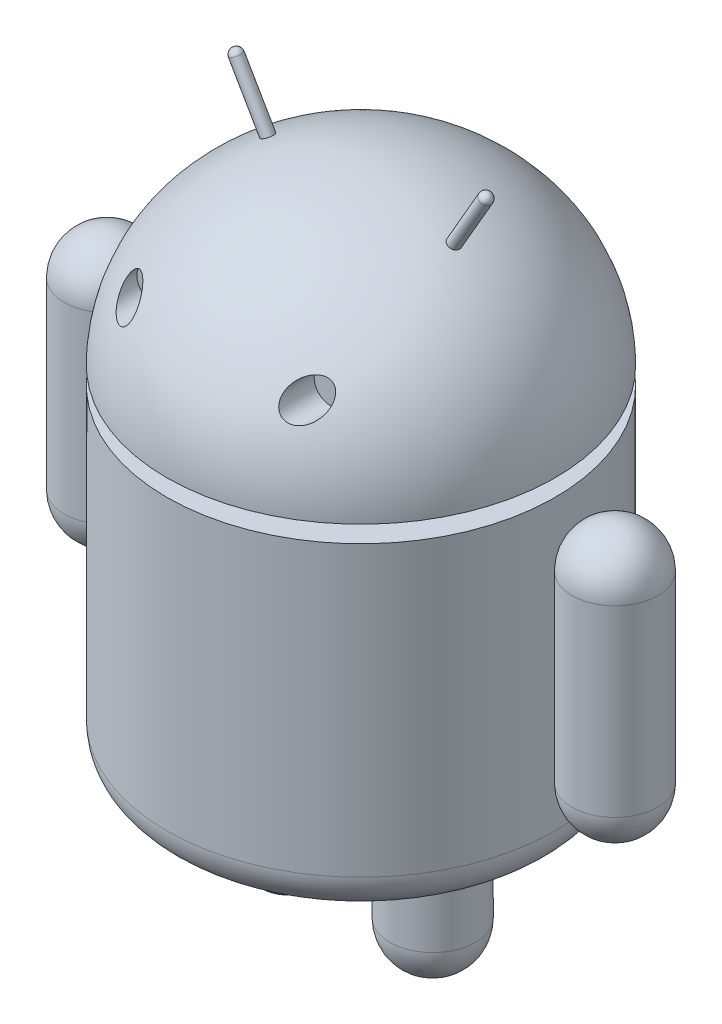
ISO-10303-21;
HEADER;
FILE_DESCRIPTION(('STEP AP214'),'2;1');
FILE_NAME('part.step','',(''),(''),'','','');
FILE_SCHEMA(('AUTOMOTIVE_DESIGN { 1 0 10303 214 1 1 1 1 }'));
ENDSEC;
DATA;
#1=APPLICATION_CONTEXT('core data for automotive mechanical design processes');
#2=APPLICATION_PROTOCOL_DEFINITION('international standard','automotive_design',2000,#1);
#3=PRODUCT_CONTEXT('',#1,'mechanical');
#4=PRODUCT('Part','Part','',(#3));
#5=PRODUCT_RELATED_PRODUCT_CATEGORY('part','',(#4));
#6=PRODUCT_DEFINITION_FORMATION('','',#4);
#7=PRODUCT_DEFINITION_CONTEXT('part definition',#1,'design');
#8=PRODUCT_DEFINITION('design','',#6,#7);
#9=PRODUCT_DEFINITION_SHAPE('','',#8);
#10=(LENGTH_UNIT() NAMED_UNIT(*) SI_UNIT(.MILLI.,.METRE.));
#11=(NAMED_UNIT(*) PLANE_ANGLE_UNIT() SI_UNIT($,.RADIAN.));
#12=(NAMED_UNIT(*) SI_UNIT($,.STERADIAN.) SOLID_ANGLE_UNIT());
#13=UNCERTAINTY_MEASURE_WITH_UNIT(LENGTH_MEASURE(1.E-05),#10,'distance_accuracy_value','');
#14=(GEOMETRIC_REPRESENTATION_CONTEXT(3) GLOBAL_UNCERTAINTY_ASSIGNED_CONTEXT((#13)) GLOBAL_UNIT_ASSIGNED_CONTEXT((#10,
#11,#12)) REPRESENTATION_CONTEXT('',''));
#15=CARTESIAN_POINT('',(0.,0.,0.));
#16=DIRECTION('',(0.,0.,1.));
#17=DIRECTION('',(1.,0.,0.));
#18=AXIS2_PLACEMENT_3D('',#15,#16,#17);
#19=CARTESIAN_POINT('',(64.77,75.184,0.));
#20=DIRECTION('',(0.,1.,0.));
#21=DIRECTION('',(-1.,0.,0.));
#22=AXIS2_PLACEMENT_3D('',#19,#20,#21);
#23=SPHERICAL_SURFACE('',#22,10.922);
#24=CARTESIAN_POINT('',(64.77,75.184,0.));
#25=DIRECTION('',(0.,-1.,0.));
#26=DIRECTION('',(1.,0.,0.));
#27=AXIS2_PLACEMENT_3D('',#24,#25,#26);
#28=CIRCLE('',#27,10.922);
#29=CARTESIAN_POINT('',(75.692,75.184,0.));
#30=VERTEX_POINT('',#29);
#31=EDGE_CURVE('E44',#30,#30,#28,.T.);
#32=ORIENTED_EDGE('',*,*,#31,.F.);
#33=EDGE_LOOP('',(#32));
#34=FACE_BOUND('',#33,.T.);
#35=ADVANCED_FACE('F38',(#34),#23,.T.);
#36=CARTESIAN_POINT('',(64.77,28.448,0.));
#37=DIRECTION('',(0.,1.,0.));
#38=DIRECTION('',(-1.,0.,0.));
#39=AXIS2_PLACEMENT_3D('',#36,#37,#38);
#40=SPHERICAL_SURFACE('',#39,10.922);
#41=CARTESIAN_POINT('',(64.77,28.448,0.));
#42=DIRECTION('',(0.,-1.,0.));
#43=DIRECTION('',(1.,0.,0.));
#44=AXIS2_PLACEMENT_3D('',#41,#42,#43);
#45=CIRCLE('',#44,10.922);
#46=CARTESIAN_POINT('',(75.692,28.448,0.));
#47=VERTEX_POINT('',#46);
#48=EDGE_CURVE('E11',#47,#47,#45,.T.);
#49=ORIENTED_EDGE('',*,*,#48,.T.);
#50=EDGE_LOOP('',(#49));
#51=FACE_BOUND('',#50,.T.);
#52=ADVANCED_FACE('F54',(#51),#40,.T.);
#53=CARTESIAN_POINT('',(64.77,86.106,0.));
#54=DIRECTION('',(0.,1.,0.));
#55=DIRECTION('',(1.,0.,0.));
#56=AXIS2_PLACEMENT_3D('',#53,#54,#55);
#57=CYLINDRICAL_SURFACE('',#56,10.922);
#58=ORIENTED_EDGE('',*,*,#31,.T.);
#59=EDGE_LOOP('',(#58));
#60=FACE_BOUND('',#59,.T.);
#61=ORIENTED_EDGE('',*,*,#48,.F.);
#62=EDGE_LOOP('',(#61));
#63=FACE_BOUND('',#62,.T.);
#64=ADVANCED_FACE('F50',(#60,#63),#57,.T.);
#65=CLOSED_SHELL('',(#35,#52,#64));
#66=MANIFOLD_SOLID_BREP('B2',#65);
#67=CARTESIAN_POINT('',(-64.77,75.184,0.));
#68=DIRECTION('',(0.,1.,0.));
#69=DIRECTION('',(1.,0.,0.));
#70=AXIS2_PLACEMENT_3D('',#67,#68,#69);
#71=SPHERICAL_SURFACE('',#70,10.922);
#72=CARTESIAN_POINT('',(-64.77,75.184,0.));
#73=DIRECTION('',(0.,1.,0.));
#74=DIRECTION('',(-1.,0.,0.));
#75=AXIS2_PLACEMENT_3D('',#72,#73,#74);
#76=CIRCLE('',#75,10.922);
#77=CARTESIAN_POINT('',(-75.692,75.184,0.));
#78=VERTEX_POINT('',#77);
#79=EDGE_CURVE('E95',#78,#78,#76,.T.);
#80=ORIENTED_EDGE('',*,*,#79,.T.);
#81=EDGE_LOOP('',(#80));
#82=FACE_BOUND('',#81,.T.);
#83=ADVANCED_FACE('F89',(#82),#71,.T.);
#84=CARTESIAN_POINT('',(-64.77,28.448,0.));
#85=DIRECTION('',(0.,1.,0.));
#86=DIRECTION('',(1.,0.,0.));
#87=AXIS2_PLACEMENT_3D('',#84,#85,#86);
#88=SPHERICAL_SURFACE('',#87,10.922);
#89=CARTESIAN_POINT('',(-64.77,28.448,0.));
#90=DIRECTION('',(0.,1.,0.));
#91=DIRECTION('',(-1.,0.,0.));
#92=AXIS2_PLACEMENT_3D('',#89,#90,#91);
#93=CIRCLE('',#92,10.922);
#94=CARTESIAN_POINT('',(-75.692,28.448,0.));
#95=VERTEX_POINT('',#94);
#96=EDGE_CURVE('E37',#95,#95,#93,.T.);
#97=ORIENTED_EDGE('',*,*,#96,.F.);
#98=EDGE_LOOP('',(#97));
#99=FACE_BOUND('',#98,.T.);
#100=ADVANCED_FACE('F104',(#99),#88,.T.);
#101=CARTESIAN_POINT('',(-64.77,86.106,0.));
#102=DIRECTION('',(0.,1.,0.));
#103=DIRECTION('',(-1.,0.,0.));
#104=AXIS2_PLACEMENT_3D('',#101,#102,#103);
#105=CYLINDRICAL_SURFACE('',#104,10.922);
#106=ORIENTED_EDGE('',*,*,#79,.F.);
#107=EDGE_LOOP('',(#106));
#108=FACE_BOUND('',#107,.T.);
#109=ORIENTED_EDGE('',*,*,#96,.T.);
#110=EDGE_LOOP('',(#109));
#111=FACE_BOUND('',#110,.T.);
#112=ADVANCED_FACE('F102',(#108,#111),#105,.T.);
#113=CLOSED_SHELL('',(#83,#100,#112));
#114=MANIFOLD_SOLID_BREP('B6',#113);
#115=CARTESIAN_POINT('',(0.,88.138,0.));
#116=DIRECTION('',(1.,0.,0.));
#117=DIRECTION('',(0.,0.,1.));
#118=AXIS2_PLACEMENT_3D('',#115,#116,#117);
#119=ELLIPSE('',#118,49.53,44.45);
#120=TRIMMED_CURVE('',#119,(PARAMETER_VALUE(4.71238898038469)),
(PARAMETER_VALUE(7.85398163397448)),.T.,.PARAMETER.);
#121=CARTESIAN_POINT('',(0.,83.82,0.));
#122=DIRECTION('',(0.,1.,0.));
#123=AXIS1_PLACEMENT('',#121,#122);
#124=SURFACE_OF_REVOLUTION('',#120,#123);
#125=CARTESIAN_POINT('',(-22.3992248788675,127.782891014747,0.));
#126=CARTESIAN_POINT('',(-22.399230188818,127.782888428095,0.0854670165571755));
#127=CARTESIAN_POINT('',(-22.4057285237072,127.779708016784,0.171023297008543));
#128=CARTESIAN_POINT('',(-22.4250581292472,127.770246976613,0.297450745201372));
#129=CARTESIAN_POINT('',(-22.4331089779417,127.766306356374,0.339309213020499));
#130=CARTESIAN_POINT('',(-22.4523542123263,127.756886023,0.422163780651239));
#131=CARTESIAN_POINT('',(-22.4635513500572,127.751404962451,0.463159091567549));
#132=CARTESIAN_POINT('',(-22.501715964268,127.732722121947,0.584236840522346));
#133=CARTESIAN_POINT('',(-22.5332828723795,127.7172678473,0.662581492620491));
#134=CARTESIAN_POINT('',(-22.6077820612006,127.680788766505,0.812258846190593));
#135=CARTESIAN_POINT('',(-22.6507147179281,127.659763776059,0.883591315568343));
#136=CARTESIAN_POINT('',(-22.7226855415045,127.624510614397,0.983830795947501));
#137=CARTESIAN_POINT('',(-22.7479724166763,127.612123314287,1.01615184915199));
#138=CARTESIAN_POINT('',(-22.8008680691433,127.586208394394,1.07828352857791));
#139=CARTESIAN_POINT('',(-22.828474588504,127.572681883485,1.10809654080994));
#140=CARTESIAN_POINT('',(-22.9145490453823,127.530502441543,1.19351377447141));
#141=CARTESIAN_POINT('',(-22.9762891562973,127.500241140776,1.24512019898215));
#142=CARTESIAN_POINT('',(-23.1067569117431,127.436275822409,1.33617214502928));
#143=CARTESIAN_POINT('',(-23.1754995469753,127.402564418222,1.37559081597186));
#144=CARTESIAN_POINT('',(-23.3179424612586,127.332689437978,1.4410518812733));
#145=CARTESIAN_POINT('',(-23.3916427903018,127.296525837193,1.46709414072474));
#146=CARTESIAN_POINT('',(-23.5420573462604,127.222696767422,1.50510215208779));
#147=CARTESIAN_POINT('',(-23.6187773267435,127.185028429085,1.51703953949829));
#148=CARTESIAN_POINT('',(-23.7729189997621,127.109323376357,1.52641122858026));
#149=CARTESIAN_POINT('',(-23.8503406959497,127.071286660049,1.52384545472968));
#150=CARTESIAN_POINT('',(-24.0037628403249,126.995888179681,1.50427177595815));
#151=CARTESIAN_POINT('',(-24.079761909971,126.958527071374,1.48725053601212));
#152=CARTESIAN_POINT('',(-24.2281063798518,126.885579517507,1.43922482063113));
#153=CARTESIAN_POINT('',(-24.3004517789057,126.84999307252,1.40822034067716));
#154=CARTESIAN_POINT('',(-24.4393924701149,126.781630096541,1.33311907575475));
#155=CARTESIAN_POINT('',(-24.5059907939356,126.748852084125,1.28902924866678));
#156=CARTESIAN_POINT('',(-24.6315801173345,126.68702534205,1.18899350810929));
#157=CARTESIAN_POINT('',(-24.6905711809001,126.657976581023,1.13304769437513));
#158=CARTESIAN_POINT('',(-24.7991638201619,126.604491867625,1.01098809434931));
#159=CARTESIAN_POINT('',(-24.8487812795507,126.580048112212,0.94489185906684));
#160=CARTESIAN_POINT('',(-24.9373296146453,126.536418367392,0.804334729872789));
#161=CARTESIAN_POINT('',(-24.9762606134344,126.517232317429,0.729873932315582));
#162=CARTESIAN_POINT('',(-25.0422462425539,126.484709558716,0.574871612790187));
#163=CARTESIAN_POINT('',(-25.0693259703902,126.471360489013,0.494343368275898));
#164=CARTESIAN_POINT('',(-25.1109517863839,126.450839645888,0.329356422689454));
#165=CARTESIAN_POINT('',(-25.1254980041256,126.443667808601,0.244897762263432));
#166=CARTESIAN_POINT('',(-25.1416251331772,126.435716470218,0.0745961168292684));
#167=CARTESIAN_POINT('',(-25.1432272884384,126.434926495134,-0.0112443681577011));
#168=CARTESIAN_POINT('',(-25.133476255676,126.439734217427,-0.182005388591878));
#169=CARTESIAN_POINT('',(-25.1221231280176,126.445331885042,-0.266925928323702));
#170=CARTESIAN_POINT('',(-25.0867959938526,126.462748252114,-0.433395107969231));
#171=CARTESIAN_POINT('',(-25.062828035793,126.474563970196,-0.514945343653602));
#172=CARTESIAN_POINT('',(-25.0029610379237,126.504072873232,-0.672407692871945));
#173=CARTESIAN_POINT('',(-24.9670619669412,126.521766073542,-0.748319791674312));
#174=CARTESIAN_POINT('',(-24.8843210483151,126.56253795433,-0.892425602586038));
#175=CARTESIAN_POINT('',(-24.837469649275,126.585621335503,-0.960612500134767));
#176=CARTESIAN_POINT('',(-24.7341759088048,126.636501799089,-1.08727054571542));
#177=CARTESIAN_POINT('',(-24.6777334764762,126.664298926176,-1.14574160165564));
#178=CARTESIAN_POINT('',(-24.5567457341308,126.723868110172,-1.2514267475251));
#179=CARTESIAN_POINT('',(-24.4921854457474,126.755647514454,-1.29861954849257));
#180=CARTESIAN_POINT('',(-24.3568769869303,126.822233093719,-1.38028410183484));
#181=CARTESIAN_POINT('',(-24.2861287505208,126.857039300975,-1.41475571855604));
#182=CARTESIAN_POINT('',(-24.1402914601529,126.928765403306,-1.47007329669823));
#183=CARTESIAN_POINT('',(-24.0651936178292,126.96568957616,-1.49089054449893));
#184=CARTESIAN_POINT('',(-23.9129200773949,127.040536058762,-1.51820305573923));
#185=CARTESIAN_POINT('',(-23.8357443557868,127.078458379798,-1.52469815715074));
#186=CARTESIAN_POINT('',(-23.6813854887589,127.154282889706,-1.52318195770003));
#187=CARTESIAN_POINT('',(-23.6042024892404,127.192184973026,-1.51514998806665));
#188=CARTESIAN_POINT('',(-23.4521411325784,127.266834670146,-1.48477334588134));
#189=CARTESIAN_POINT('',(-23.3772627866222,127.303582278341,-1.46242860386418));
#190=CARTESIAN_POINT('',(-23.2318881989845,127.374906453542,-1.40401701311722));
#191=CARTESIAN_POINT('',(-23.1613925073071,127.409482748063,-1.36794844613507));
#192=CARTESIAN_POINT('',(-23.0605583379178,127.458926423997,-1.30439810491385));
#193=CARTESIAN_POINT('',(-23.0277596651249,127.47500688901,-1.28163508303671));
#194=CARTESIAN_POINT('',(-22.9639673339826,127.506278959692,-1.23308892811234));
#195=CARTESIAN_POINT('',(-22.9329754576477,127.521469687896,-1.20730288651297));
#196=CARTESIAN_POINT('',(-22.8432240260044,127.565456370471,-1.12580716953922));
#197=CARTESIAN_POINT('',(-22.787508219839,127.592755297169,-1.06584590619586));
#198=CARTESIAN_POINT('',(-22.685942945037,127.642509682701,-0.936329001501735));
#199=CARTESIAN_POINT('',(-22.6400930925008,127.664965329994,-0.866773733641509));
#200=CARTESIAN_POINT('',(-22.5797432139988,127.694518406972,-0.756850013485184));
#201=CARTESIAN_POINT('',(-22.5610323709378,127.703680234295,-0.719281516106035));
#202=CARTESIAN_POINT('',(-22.5265388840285,127.720569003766,-0.642558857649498));
#203=CARTESIAN_POINT('',(-22.5107536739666,127.728297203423,-0.603406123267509));
#204=CARTESIAN_POINT('',(-22.4679733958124,127.749240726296,-0.483982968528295));
#205=CARTESIAN_POINT('',(-22.4454857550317,127.760248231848,-0.401623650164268));
#206=CARTESIAN_POINT('',(-22.4193681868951,127.77303202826,-0.265625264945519));
#207=CARTESIAN_POINT('',(-22.4118252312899,127.776723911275,-0.212861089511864));
#208=CARTESIAN_POINT('',(-22.4017519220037,127.781654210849,-0.106742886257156));
#209=CARTESIAN_POINT('',(-22.3992215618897,127.782892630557,-0.0533888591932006));
#210=CARTESIAN_POINT('',(-22.3992248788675,127.782891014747,0.));
#211=B_SPLINE_CURVE_WITH_KNOTS('',3,(#125,#126,#127,#128,#129,#130,#131,#132,#133,#134,#135,
#136,#137,#138,#139,#140,#141,#142,#143,#144,#145,#146,#147,#148,#149,#150,#151,#152,#153,#154,
#155,#156,#157,#158,#159,#160,#161,#162,#163,#164,#165,#166,#167,#168,#169,#170,#171,#172,#173,
#174,#175,#176,#177,#178,#179,#180,#181,#182,#183,#184,#185,#186,#187,#188,#189,#190,#191,#192,
#193,#194,#195,#196,#197,#198,#199,#200,#201,#202,#203,#204,#205,#206,#207,#208,#209,#210),
.UNSPECIFIED.,.T.,.F.,(4,2,2,2,2,2,2,2,2,2,2,2,2,2,2,2,2,2,2,2,2,2,2,2,2,2,2,2,2,2,2,2,2,2,2,2,
2,2,2,2,2,2,4),(0.,0.256172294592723,0.384470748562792,0.512881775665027,0.769191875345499,
1.02551045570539,1.15397594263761,1.28231779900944,1.53891039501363,1.79606432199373,
2.05322084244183,2.31089362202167,2.56856774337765,2.82647982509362,3.08439199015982,
3.34216726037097,3.5999403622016,3.8572726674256,4.11460200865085,4.37138373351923,
4.62816280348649,4.88452035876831,5.14087671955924,5.39711027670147,5.65334450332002,
5.90980302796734,6.16626398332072,6.42320527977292,6.68014931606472,6.93763195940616,
7.19511751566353,7.45296970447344,7.71082314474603,7.96870887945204,8.09769861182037,
8.22681348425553,8.48435902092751,8.74189453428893,8.87063329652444,8.99925859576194,
9.25607897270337,9.41610285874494,9.57612653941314),.UNSPECIFIED.);
#212=CARTESIAN_POINT('',(-22.3992248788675,127.782891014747,0.));
#213=VERTEX_POINT('',#212);
#214=EDGE_CURVE('E163',#213,#213,#211,.T.);
#215=ORIENTED_EDGE('',*,*,#214,.T.);
#216=EDGE_LOOP('',(#215));
#217=FACE_BOUND('',#216,.T.);
#218=CARTESIAN_POINT('',(26.67,109.982,33.9038957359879));
#219=CARTESIAN_POINT('',(26.669999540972,110.088967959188,33.8183242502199));
#220=CARTESIAN_POINT('',(26.6657777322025,110.197106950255,33.7341832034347));
#221=CARTESIAN_POINT('',(26.6483119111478,110.415373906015,33.5694936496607));
#222=CARTESIAN_POINT('',(26.6350648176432,110.525502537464,33.4889463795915));
#223=CARTESIAN_POINT('',(26.5807506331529,110.85832285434,33.253935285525));
#224=CARTESIAN_POINT('',(26.525113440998,111.08367154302,33.1059219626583));
#225=CARTESIAN_POINT('',(26.3916535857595,111.469867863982,32.8759908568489));
#226=CARTESIAN_POINT('',(26.3248867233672,111.630538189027,32.7873327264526));
#227=CARTESIAN_POINT('',(26.1667711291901,111.94884088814,32.6284163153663));
#228=CARTESIAN_POINT('',(26.0754645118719,112.106477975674,32.5581269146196));
#229=CARTESIAN_POINT('',(25.8843724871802,112.388748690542,32.4507008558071));
#230=CARTESIAN_POINT('',(25.7883924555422,112.514574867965,32.4100285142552));
#231=CARTESIAN_POINT('',(25.6319072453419,112.696110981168,32.3636231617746));
#232=CARTESIAN_POINT('',(25.5776442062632,112.755436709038,32.3505871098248));
#233=CARTESIAN_POINT('',(25.4652111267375,112.871204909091,32.3296400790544));
#234=CARTESIAN_POINT('',(25.4070426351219,112.927648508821,32.32172708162));
#235=CARTESIAN_POINT('',(25.2869464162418,113.03736641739,32.3111924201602));
#236=CARTESIAN_POINT('',(25.2250058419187,113.090628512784,32.3085900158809));
#237=CARTESIAN_POINT('',(25.098036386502,113.193310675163,32.3088035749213));
#238=CARTESIAN_POINT('',(25.0330077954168,113.24273110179,32.3116190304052));
#239=CARTESIAN_POINT('',(24.9003955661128,113.337365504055,32.3226191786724));
#240=CARTESIAN_POINT('',(24.8328119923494,113.382579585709,32.3308037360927));
#241=CARTESIAN_POINT('',(24.6956510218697,113.468548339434,32.3523691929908));
#242=CARTESIAN_POINT('',(24.6260728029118,113.509301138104,32.3657522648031));
#243=CARTESIAN_POINT('',(24.4221166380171,113.620812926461,32.411769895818));
#244=CARTESIAN_POINT('',(24.2858218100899,113.685535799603,32.4508869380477));
#245=CARTESIAN_POINT('',(24.0115512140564,113.798095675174,32.5445859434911));
#246=CARTESIAN_POINT('',(23.8735734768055,113.845910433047,32.5991881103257));
#247=CARTESIAN_POINT('',(23.6353416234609,113.914884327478,32.7048117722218));
#248=CARTESIAN_POINT('',(23.5348233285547,113.93975093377,32.7529169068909));
#249=CARTESIAN_POINT('',(23.3351643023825,113.981350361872,32.8548934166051));
#250=CARTESIAN_POINT('',(23.2360224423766,113.998090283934,32.9087597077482));
#251=CARTESIAN_POINT('',(23.0393373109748,114.024051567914,33.021511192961));
#252=CARTESIAN_POINT('',(22.941798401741,114.03325495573,33.0804080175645));
#253=CARTESIAN_POINT('',(22.7489002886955,114.044636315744,33.2023345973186));
#254=CARTESIAN_POINT('',(22.6535418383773,114.046811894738,33.2653657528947));
#255=CARTESIAN_POINT('',(22.4248296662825,114.044190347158,33.4226988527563));
#256=CARTESIAN_POINT('',(22.2927485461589,114.035996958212,33.5188038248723));
#257=CARTESIAN_POINT('',(22.0340591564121,114.007657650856,33.7164451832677));
#258=CARTESIAN_POINT('',(21.9074526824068,113.987507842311,33.8179833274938));
#259=CARTESIAN_POINT('',(21.6598479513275,113.936350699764,34.0253450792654));
#260=CARTESIAN_POINT('',(21.5388564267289,113.905330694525,34.1311735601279));
#261=CARTESIAN_POINT('',(21.3028206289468,113.833368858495,34.3459953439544));
#262=CARTESIAN_POINT('',(21.1877763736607,113.792426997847,34.4549886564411));
#263=CARTESIAN_POINT('',(20.9276416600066,113.686696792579,34.7108649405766));
#264=CARTESIAN_POINT('',(20.7848148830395,113.618475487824,34.8586399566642));
#265=CARTESIAN_POINT('',(20.5100734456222,113.467365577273,35.1568393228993));
#266=CARTESIAN_POINT('',(20.3781620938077,113.384472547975,35.3072644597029));
#267=CARTESIAN_POINT('',(20.1255781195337,113.204983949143,35.6096391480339));
#268=CARTESIAN_POINT('',(20.0049157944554,113.108376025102,35.7615899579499));
#269=CARTESIAN_POINT('',(19.775537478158,112.902332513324,36.0657695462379));
#270=CARTESIAN_POINT('',(19.6668201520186,112.792898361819,36.2179982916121));
#271=CARTESIAN_POINT('',(19.4610817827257,112.560733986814,36.5231668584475));
#272=CARTESIAN_POINT('',(19.364181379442,112.437887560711,36.6760997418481));
#273=CARTESIAN_POINT('',(19.1842653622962,112.180297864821,36.9801725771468));
#274=CARTESIAN_POINT('',(19.1012519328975,112.045552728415,37.1313122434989));
#275=CARTESIAN_POINT('',(18.9504989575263,111.76490236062,37.4303974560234));
#276=CARTESIAN_POINT('',(18.8827368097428,111.619014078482,37.5783474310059));
#277=CARTESIAN_POINT('',(18.7639431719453,111.31657085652,37.8698579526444));
#278=CARTESIAN_POINT('',(18.7129038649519,111.160020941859,38.013420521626));
#279=CARTESIAN_POINT('',(18.6144758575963,110.779005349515,38.3450372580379));
#280=CARTESIAN_POINT('',(18.5749203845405,110.55027332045,38.5306417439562));
#281=CARTESIAN_POINT('',(18.5362146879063,110.0773317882,38.8856050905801));
#282=CARTESIAN_POINT('',(18.537005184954,109.833145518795,39.0549874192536));
#283=CARTESIAN_POINT('',(18.5805932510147,109.390439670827,39.3349819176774));
#284=CARTESIAN_POINT('',(18.6139273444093,109.193964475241,39.4502539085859));
#285=CARTESIAN_POINT('',(18.7126764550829,108.799017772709,39.662240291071));
#286=CARTESIAN_POINT('',(18.7780522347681,108.600548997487,39.7589771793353));
#287=CARTESIAN_POINT('',(18.9290422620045,108.242201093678,39.9138151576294));
#288=CARTESIAN_POINT('',(19.0090939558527,108.081660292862,39.9757169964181));
#289=CARTESIAN_POINT('',(19.1470076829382,107.846641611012,40.0541558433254));
#290=CARTESIAN_POINT('',(19.1959686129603,107.769245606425,40.0779046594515));
#291=CARTESIAN_POINT('',(19.2997269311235,107.617021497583,40.1202722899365));
#292=CARTESIAN_POINT('',(19.3545218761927,107.542192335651,40.1388932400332));
#293=CARTESIAN_POINT('',(19.4700555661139,107.395355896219,40.170810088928));
#294=CARTESIAN_POINT('',(19.5308263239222,107.323367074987,40.1840751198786));
#295=CARTESIAN_POINT('',(19.6576551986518,107.183380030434,40.2049080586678));
#296=CARTESIAN_POINT('',(19.7237110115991,107.115380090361,40.2124784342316));
#297=CARTESIAN_POINT('',(19.8606407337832,106.983983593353,40.2218085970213));
#298=CARTESIAN_POINT('',(19.9315147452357,106.920587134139,40.2235682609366));
#299=CARTESIAN_POINT('',(20.077475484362,106.798969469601,40.2212611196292));
#300=CARTESIAN_POINT('',(20.1525619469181,106.740747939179,40.2171946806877));
#301=CARTESIAN_POINT('',(20.2995913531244,106.634753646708,40.2039299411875));
#302=CARTESIAN_POINT('',(20.3712405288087,106.586512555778,40.1952082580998));
#303=CARTESIAN_POINT('',(20.5169494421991,106.494969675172,40.1731305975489));
#304=CARTESIAN_POINT('',(20.591009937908,106.451669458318,40.1597731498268));
#305=CARTESIAN_POINT('',(20.8159243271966,106.32950026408,40.1130338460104));
#306=CARTESIAN_POINT('',(20.9696447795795,106.258267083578,40.072972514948));
#307=CARTESIAN_POINT('',(21.2866973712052,106.134172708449,39.9751568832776));
#308=CARTESIAN_POINT('',(21.450163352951,106.082198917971,39.9167359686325));
#309=CARTESIAN_POINT('',(21.7767295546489,105.999940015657,39.7855064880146));
#310=CARTESIAN_POINT('',(21.9398295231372,105.969666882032,39.7126900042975));
#311=CARTESIAN_POINT('',(22.3348247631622,105.920237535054,39.5200056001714));
#312=CARTESIAN_POINT('',(22.5649462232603,105.912067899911,39.3936402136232));
#313=CARTESIAN_POINT('',(23.0125015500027,105.932151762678,39.122552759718));
#314=CARTESIAN_POINT('',(23.2299070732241,105.960483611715,38.9777918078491));
#315=CARTESIAN_POINT('',(23.7146694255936,106.062035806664,38.6271177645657));
#316=CARTESIAN_POINT('',(23.976110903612,106.146608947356,38.4163326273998));
#317=CARTESIAN_POINT('',(24.4667125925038,106.359096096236,37.9801329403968));
#318=CARTESIAN_POINT('',(24.695854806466,106.487034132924,37.7547103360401));
#319=CARTESIAN_POINT('',(25.1240574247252,106.781328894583,37.2903861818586));
#320=CARTESIAN_POINT('',(25.3224238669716,106.948403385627,37.0513051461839));
#321=CARTESIAN_POINT('',(25.6819109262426,107.313558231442,36.5683142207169));
#322=CARTESIAN_POINT('',(25.8429888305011,107.511673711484,36.3243991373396));
#323=CARTESIAN_POINT('',(26.0693687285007,107.850180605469,35.9332274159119));
#324=CARTESIAN_POINT('',(26.1473257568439,107.982323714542,35.7859821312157));
#325=CARTESIAN_POINT('',(26.2881905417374,108.255391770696,35.4922683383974));
#326=CARTESIAN_POINT('',(26.3510933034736,108.396319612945,35.3458001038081));
#327=CARTESIAN_POINT('',(26.4608249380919,108.685731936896,35.0551966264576));
#328=CARTESIAN_POINT('',(26.5076985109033,108.834194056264,34.9110559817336));
#329=CARTESIAN_POINT('',(26.5845412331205,109.138272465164,34.6259914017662));
#330=CARTESIAN_POINT('',(26.6145235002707,109.293883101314,34.4850650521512));
#331=CARTESIAN_POINT('',(26.6467279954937,109.539062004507,34.2711735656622));
#332=CARTESIAN_POINT('',(26.6553745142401,109.626368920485,34.1965374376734));
#333=CARTESIAN_POINT('',(26.6670128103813,109.802840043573,34.0488944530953));
#334=CARTESIAN_POINT('',(26.67000038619,109.892005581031,33.9758888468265));
#335=CARTESIAN_POINT('',(26.67,109.982,33.9038957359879));
#336=B_SPLINE_CURVE_WITH_KNOTS('',3,(#218,#219,#220,#221,#222,#223,#224,#225,#226,#227,#228,
#229,#230,#231,#232,#233,#234,#235,#236,#237,#238,#239,#240,#241,#242,#243,#244,#245,#246,#247,
#248,#249,#250,#251,#252,#253,#254,#255,#256,#257,#258,#259,#260,#261,#262,#263,#264,#265,#266,
#267,#268,#269,#270,#271,#272,#273,#274,#275,#276,#277,#278,#279,#280,#281,#282,#283,#284,#285,
#286,#287,#288,#289,#290,#291,#292,#293,#294,#295,#296,#297,#298,#299,#300,#301,#302,#303,#304,
#305,#306,#307,#308,#309,#310,#311,#312,#313,#314,#315,#316,#317,#318,#319,#320,#321,#322,#323,
#324,#325,#326,#327,#328,#329,#330,#331,#332,#333,#334,#335),.UNSPECIFIED.,.T.,.F.,(4,2,2,2,2,2,
2,2,2,2,2,2,2,2,2,2,2,2,2,2,2,2,2,2,2,2,2,2,2,2,2,2,2,2,2,2,2,2,2,2,2,2,2,2,2,2,2,2,2,2,2,2,2,2,
2,2,2,2,4),(0.,0.410869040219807,0.821878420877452,1.64304591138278,2.22693640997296,
2.80983118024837,3.29775362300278,3.54183942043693,3.78582898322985,4.03070185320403,
4.27555177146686,4.52039551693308,4.76534168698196,5.23091966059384,5.69710789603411,
6.0391914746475,6.3809756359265,6.72357257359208,7.06628616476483,7.55620127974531,
8.04627588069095,8.53692366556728,9.02757292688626,9.67632604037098,10.3252750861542,
10.9748124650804,11.6242771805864,12.2798982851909,12.9356224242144,13.5903683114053,
14.2448077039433,15.1332905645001,16.0204680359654,16.7086197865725,17.395930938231,
17.962664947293,18.2461984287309,18.5296136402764,18.8146397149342,19.0995422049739,
19.3844507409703,19.6693413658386,19.9294774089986,20.1896960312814,20.7096447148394,
21.2512201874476,21.7930943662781,22.5767385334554,23.3620676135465,24.3954773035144,
25.4294605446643,26.4841410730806,27.5400237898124,28.1773582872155,28.8149039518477,
29.450656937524,30.0859155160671,30.4313320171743,30.777004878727),.UNSPECIFIED.);
#337=CARTESIAN_POINT('',(26.67,109.982,33.9038957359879));
#338=VERTEX_POINT('',#337);
#339=EDGE_CURVE('E173',#338,#338,#336,.T.);
#340=ORIENTED_EDGE('',*,*,#339,.F.);
#341=EDGE_LOOP('',(#340));
#342=FACE_BOUND('',#341,.T.);
#343=CARTESIAN_POINT('',(-18.542,109.982,38.9481357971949));
#344=CARTESIAN_POINT('',(-18.5419846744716,110.265488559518,38.7507303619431));
#345=CARTESIAN_POINT('',(-18.5715864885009,110.539739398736,38.540291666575));
#346=CARTESIAN_POINT('',(-18.6524917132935,110.932674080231,38.2124439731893));
#347=CARTESIAN_POINT('',(-18.6855899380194,111.06068511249,38.1010244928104));
#348=CARTESIAN_POINT('',(-18.762976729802,111.310281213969,37.8748568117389));
#349=CARTESIAN_POINT('',(-18.8072653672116,111.431866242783,37.7601085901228));
#350=CARTESIAN_POINT('',(-18.918270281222,111.697292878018,37.4995391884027));
#351=CARTESIAN_POINT('',(-18.9878235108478,111.839256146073,37.3530152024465));
#352=CARTESIAN_POINT('',(-19.141427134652,112.112104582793,37.0572481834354));
#353=CARTESIAN_POINT('',(-19.2254811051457,112.242987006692,36.9080044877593));
#354=CARTESIAN_POINT('',(-19.4070205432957,112.493285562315,36.6077472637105));
#355=CARTESIAN_POINT('',(-19.5045210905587,112.612688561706,36.4567319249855));
#356=CARTESIAN_POINT('',(-19.7119557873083,112.839306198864,36.1541353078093));
#357=CARTESIAN_POINT('',(-19.8218887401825,112.946522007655,36.0025540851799));
#358=CARTESIAN_POINT('',(-20.0545584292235,113.149057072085,35.6984373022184));
#359=CARTESIAN_POINT('',(-20.177403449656,113.244258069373,35.5459057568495));
#360=CARTESIAN_POINT('',(-20.4345361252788,113.420773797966,35.2423768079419));
#361=CARTESIAN_POINT('',(-20.5688259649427,113.502085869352,35.0913797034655));
#362=CARTESIAN_POINT('',(-20.8481948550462,113.649578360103,34.7924879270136));
#363=CARTESIAN_POINT('',(-20.9932560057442,113.71578317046,34.6445886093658));
#364=CARTESIAN_POINT('',(-21.2939888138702,113.831764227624,34.3532657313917));
#365=CARTESIAN_POINT('',(-21.449654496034,113.881549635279,34.209839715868));
#366=CARTESIAN_POINT('',(-21.7112488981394,113.947641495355,33.9818049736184));
#367=CARTESIAN_POINT('',(-21.8140633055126,113.969508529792,33.8952183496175));
#368=CARTESIAN_POINT('',(-22.0236138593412,114.0054602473,33.7252412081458));
#369=CARTESIAN_POINT('',(-22.1303506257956,114.019543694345,33.6418512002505));
#370=CARTESIAN_POINT('',(-22.4559584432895,114.049067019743,33.3978008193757));
#371=CARTESIAN_POINT('',(-22.6806716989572,114.051897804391,33.242867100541));
#372=CARTESIAN_POINT('',(-23.0852807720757,114.02140399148,32.9924278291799));
#373=CARTESIAN_POINT('',(-23.2625860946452,113.996811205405,32.8916832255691));
#374=CARTESIAN_POINT('',(-23.6213449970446,113.921372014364,32.7090160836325));
#375=CARTESIAN_POINT('',(-23.802792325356,113.870562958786,32.6270670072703));
#376=CARTESIAN_POINT('',(-24.130199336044,113.752548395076,32.5013978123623));
#377=CARTESIAN_POINT('',(-24.2762723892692,113.690375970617,32.4533564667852));
#378=CARTESIAN_POINT('',(-24.4919873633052,113.582782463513,32.3958599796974));
#379=CARTESIAN_POINT('',(-24.5633388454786,113.544520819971,32.3791204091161));
#380=CARTESIAN_POINT('',(-24.7043676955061,113.463315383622,32.3508022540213));
#381=CARTESIAN_POINT('',(-24.7740457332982,113.420373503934,32.3392215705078));
#382=CARTESIAN_POINT('',(-24.9114741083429,113.329789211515,32.3214182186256));
#383=CARTESIAN_POINT('',(-24.9792136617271,113.282125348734,32.3152213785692));
#384=CARTESIAN_POINT('',(-25.1118203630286,113.182598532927,32.3084080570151));
#385=CARTESIAN_POINT('',(-25.1766878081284,113.130736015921,32.3077909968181));
#386=CARTESIAN_POINT('',(-25.3030056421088,113.023238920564,32.3121367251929));
#387=CARTESIAN_POINT('',(-25.3644564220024,112.967604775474,32.3170988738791));
#388=CARTESIAN_POINT('',(-25.4835181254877,112.853030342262,32.3324763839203));
#389=CARTESIAN_POINT('',(-25.5411273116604,112.794088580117,32.3428941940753));
#390=CARTESIAN_POINT('',(-25.6483996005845,112.677504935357,32.3680681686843));
#391=CARTESIAN_POINT('',(-25.6983365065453,112.620041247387,32.3824862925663));
#392=CARTESIAN_POINT('',(-25.7943599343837,112.503148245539,32.4155908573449));
#393=CARTESIAN_POINT('',(-25.8404450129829,112.44371820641,32.4342788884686));
#394=CARTESIAN_POINT('',(-25.9728001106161,112.263011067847,32.4963343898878));
#395=CARTESIAN_POINT('',(-26.0531411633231,112.139348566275,32.545686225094));
#396=CARTESIAN_POINT('',(-26.1768222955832,111.925174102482,32.6413297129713));
#397=CARTESIAN_POINT('',(-26.2241427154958,111.835421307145,32.6843763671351));
#398=CARTESIAN_POINT('',(-26.3109499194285,111.655149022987,32.7761514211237));
#399=CARTESIAN_POINT('',(-26.3504437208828,111.564630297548,32.8248746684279));
#400=CARTESIAN_POINT('',(-26.4220476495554,111.383218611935,32.9272901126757));
#401=CARTESIAN_POINT('',(-26.454141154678,111.292325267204,32.9809931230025));
#402=CARTESIAN_POINT('',(-26.511237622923,111.110834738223,33.0925414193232));
#403=CARTESIAN_POINT('',(-26.5362381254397,111.020237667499,33.1503881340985));
#404=CARTESIAN_POINT('',(-26.5883364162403,110.803055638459,33.2937923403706));
#405=CARTESIAN_POINT('',(-26.612159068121,110.676804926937,33.381059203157));
#406=CARTESIAN_POINT('',(-26.6475960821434,110.426502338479,33.5609815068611));
#407=CARTESIAN_POINT('',(-26.6592067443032,110.302451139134,33.6536385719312));
#408=CARTESIAN_POINT('',(-26.6771552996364,109.934125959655,33.9381388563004));
#409=CARTESIAN_POINT('',(-26.6665797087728,109.693815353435,34.1364202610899));
#410=CARTESIAN_POINT('',(-26.6163925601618,109.305809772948,34.4745001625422));
#411=CARTESIAN_POINT('',(-26.5877106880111,109.154087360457,34.6116057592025));
#412=CARTESIAN_POINT('',(-26.514283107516,108.857380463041,34.8889332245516));
#413=CARTESIAN_POINT('',(-26.4695324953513,108.712398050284,35.0291560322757));
#414=CARTESIAN_POINT('',(-26.3649346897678,108.42983335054,35.3115538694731));
#415=CARTESIAN_POINT('',(-26.3050779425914,108.292255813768,35.4537300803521));
#416=CARTESIAN_POINT('',(-26.1710530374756,108.025268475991,35.7389679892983));
#417=CARTESIAN_POINT('',(-26.0968863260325,107.895857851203,35.8820295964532));
#418=CARTESIAN_POINT('',(-25.9338845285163,107.644484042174,36.1698382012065));
#419=CARTESIAN_POINT('',(-25.8448880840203,107.522625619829,36.314585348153));
#420=CARTESIAN_POINT('',(-25.6533360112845,107.288921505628,36.6032206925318));
#421=CARTESIAN_POINT('',(-25.5507790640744,107.17707678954,36.7471088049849));
#422=CARTESIAN_POINT('',(-25.3326065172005,106.964572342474,37.0329874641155));
#423=CARTESIAN_POINT('',(-25.2170036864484,106.863901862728,37.1749797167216));
#424=CARTESIAN_POINT('',(-24.9730637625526,106.674895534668,37.4562057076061));
#425=CARTESIAN_POINT('',(-24.8447237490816,106.586562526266,37.5954388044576));
#426=CARTESIAN_POINT('',(-24.499152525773,106.37744358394,37.9481254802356));
#427=CARTESIAN_POINT('',(-24.2727815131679,106.266656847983,38.1588977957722));
#428=CARTESIAN_POINT('',(-23.9124097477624,106.131565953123,38.4635344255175));
#429=CARTESIAN_POINT('',(-23.7888406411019,106.091721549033,38.5631428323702));
#430=CARTESIAN_POINT('',(-23.5350475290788,106.023436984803,38.7577728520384));
#431=CARTESIAN_POINT('',(-23.4048246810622,105.994994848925,38.8527952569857));
#432=CARTESIAN_POINT('',(-23.1702282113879,105.956046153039,39.0151254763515));
#433=CARTESIAN_POINT('',(-23.0671164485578,105.942877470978,39.0836286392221));
#434=CARTESIAN_POINT('',(-22.8577955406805,105.924447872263,39.2168010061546));
#435=CARTESIAN_POINT('',(-22.7515877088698,105.919183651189,39.2814718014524));
#436=CARTESIAN_POINT('',(-22.5366562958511,105.917173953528,39.4063010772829));
#437=CARTESIAN_POINT('',(-22.4279367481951,105.920415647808,39.4664662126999));
#438=CARTESIAN_POINT('',(-22.208350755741,105.935999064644,39.5817521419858));
#439=CARTESIAN_POINT('',(-22.0974818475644,105.948351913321,39.636866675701));
#440=CARTESIAN_POINT('',(-21.8061277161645,105.993355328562,39.7731621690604));
#441=CARTESIAN_POINT('',(-21.6244940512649,106.03379602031,39.8496959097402));
#442=CARTESIAN_POINT('',(-21.3531402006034,106.114781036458,39.9502534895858));
#443=CARTESIAN_POINT('',(-21.2628840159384,106.145157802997,39.9813955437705));
#444=CARTESIAN_POINT('',(-21.0833474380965,106.212808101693,40.0385299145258));
#445=CARTESIAN_POINT('',(-20.9940665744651,106.250078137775,40.0645248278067));
#446=CARTESIAN_POINT('',(-20.8164742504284,106.331885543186,40.1111430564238));
#447=CARTESIAN_POINT('',(-20.7281774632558,106.376481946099,40.1317188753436));
#448=CARTESIAN_POINT('',(-20.554217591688,106.472562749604,40.1668179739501));
#449=CARTESIAN_POINT('',(-20.46855310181,106.524043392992,40.1813445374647));
#450=CARTESIAN_POINT('',(-20.3007084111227,106.633602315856,40.204057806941));
#451=CARTESIAN_POINT('',(-20.2185270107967,106.691678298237,40.2122467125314));
#452=CARTESIAN_POINT('',(-20.0584603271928,106.81399111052,40.222105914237));
#453=CARTESIAN_POINT('',(-19.9805750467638,106.878227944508,40.2237762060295));
#454=CARTESIAN_POINT('',(-19.8391234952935,107.004027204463,40.2207431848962));
#455=CARTESIAN_POINT('',(-19.7749720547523,107.064952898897,40.2167957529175));
#456=CARTESIAN_POINT('',(-19.651002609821,107.190606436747,40.2038913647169));
#457=CARTESIAN_POINT('',(-19.5911860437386,107.255335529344,40.1949327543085));
#458=CARTESIAN_POINT('',(-19.4763024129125,107.38801019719,40.1721351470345));
#459=CARTESIAN_POINT('',(-19.4212330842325,107.455954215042,40.15829849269));
#460=CARTESIAN_POINT('',(-19.3160634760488,107.594533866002,40.1259420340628));
#461=CARTESIAN_POINT('',(-19.2659650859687,107.665170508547,40.1074204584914));
#462=CARTESIAN_POINT('',(-19.1240209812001,107.879366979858,40.0454421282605));
#463=CARTESIAN_POINT('',(-19.0397324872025,108.02613938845,39.9954088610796));
#464=CARTESIAN_POINT('',(-18.8918762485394,108.32395868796,39.8801029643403));
#465=CARTESIAN_POINT('',(-18.8283189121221,108.475007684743,39.8148227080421));
#466=CARTESIAN_POINT('',(-18.7342347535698,108.740921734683,39.6890600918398));
#467=CARTESIAN_POINT('',(-18.6994315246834,108.8556055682,39.6313059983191));
#468=CARTESIAN_POINT('',(-18.6405987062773,109.084419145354,39.5094979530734));
#469=CARTESIAN_POINT('',(-18.6165738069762,109.198548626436,39.4454412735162));
#470=CARTESIAN_POINT('',(-18.5596532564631,109.539064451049,39.244984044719));
#471=CARTESIAN_POINT('',(-18.5420118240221,109.76328160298,39.1004389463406));
#472=CARTESIAN_POINT('',(-18.542,109.982,38.9481357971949));
#473=B_SPLINE_CURVE_WITH_KNOTS('',3,(#343,#344,#345,#346,#347,#348,#349,#350,#351,#352,#353,
#354,#355,#356,#357,#358,#359,#360,#361,#362,#363,#364,#365,#366,#367,#368,#369,#370,#371,#372,
#373,#374,#375,#376,#377,#378,#379,#380,#381,#382,#383,#384,#385,#386,#387,#388,#389,#390,#391,
#392,#393,#394,#395,#396,#397,#398,#399,#400,#401,#402,#403,#404,#405,#406,#407,#408,#409,#410,
#411,#412,#413,#414,#415,#416,#417,#418,#419,#420,#421,#422,#423,#424,#425,#426,#427,#428,#429,
#430,#431,#432,#433,#434,#435,#436,#437,#438,#439,#440,#441,#442,#443,#444,#445,#446,#447,#448,
#449,#450,#451,#452,#453,#454,#455,#456,#457,#458,#459,#460,#461,#462,#463,#464,#465,#466,#467,
#468,#469,#470,#471,#472),.UNSPECIFIED.,.T.,.F.,(4,2,2,2,2,2,2,2,2,2,2,2,2,2,2,2,2,2,2,2,2,2,2,
2,2,2,2,2,2,2,2,2,2,2,2,2,2,2,2,2,2,2,2,2,2,2,2,2,2,2,2,2,2,2,2,2,2,2,2,2,2,2,2,2,4),(0.,
1.03481384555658,1.55315041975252,2.07149025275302,2.71728117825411,3.3632316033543,
4.00991240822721,4.65653102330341,5.30908618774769,5.96176618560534,6.61338484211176,
7.26463932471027,7.67289165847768,8.08120880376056,8.89604300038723,9.51021947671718,
10.1235233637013,10.618869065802,10.8666291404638,11.1142883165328,11.3631291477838,
11.6119441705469,11.860730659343,12.1096289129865,12.3418247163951,12.5741071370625,
13.0388007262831,13.3690615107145,13.6990248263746,14.0297222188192,14.3605341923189,
14.8257584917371,15.2911237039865,16.2223447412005,16.841199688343,17.4602436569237,
18.0796801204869,18.6990540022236,19.3256693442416,19.9523456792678,20.5784138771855,
21.2046259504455,22.1859179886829,22.676388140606,23.16677326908,23.5399379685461,
23.9129466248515,24.2853930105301,24.6582949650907,25.2590254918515,25.5593082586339,
25.8594391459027,26.1621190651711,26.4646344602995,26.7670448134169,27.0694553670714,
27.3348115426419,27.6002553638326,27.8655718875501,28.1309888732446,28.6581750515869,
29.1856255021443,29.5841360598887,29.9828198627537,30.7812041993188),.UNSPECIFIED.);
#474=CARTESIAN_POINT('',(-18.542,109.982,38.9481357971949));
#475=VERTEX_POINT('',#474);
#476=EDGE_CURVE('E149',#475,#475,#473,.T.);
#477=ORIENTED_EDGE('',*,*,#476,.F.);
#478=EDGE_LOOP('',(#477));
#479=FACE_BOUND('',#478,.T.);
#480=CARTESIAN_POINT('',(0.,88.138,0.));
#481=DIRECTION('',(0.,1.,0.));
#482=DIRECTION('',(0.,0.,1.));
#483=AXIS2_PLACEMENT_3D('',#480,#481,#482);
#484=CIRCLE('',#483,49.53);
#485=CARTESIAN_POINT('',(0.,88.138,49.53));
#486=VERTEX_POINT('',#485);
#487=EDGE_CURVE('E87',#486,#486,#484,.T.);
#488=ORIENTED_EDGE('',*,*,#487,.T.);
#489=EDGE_LOOP('',(#488));
#490=FACE_BOUND('',#489,.T.);
#491=CARTESIAN_POINT('',(0.,132.588,0.));
#492=VERTEX_POINT('',#491);
#493=VERTEX_LOOP('',#492);
#494=FACE_BOUND('',#493,.T.);
#495=CARTESIAN_POINT('',(22.3992248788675,127.782891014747,0.));
#496=CARTESIAN_POINT('',(22.3992301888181,127.782888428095,-0.0854670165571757));
#497=CARTESIAN_POINT('',(22.4057285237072,127.779708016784,-0.171023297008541));
#498=CARTESIAN_POINT('',(22.4250581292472,127.770246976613,-0.297450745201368));
#499=CARTESIAN_POINT('',(22.4331089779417,127.766306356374,-0.339309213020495));
#500=CARTESIAN_POINT('',(22.4523542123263,127.756886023,-0.422163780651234));
#501=CARTESIAN_POINT('',(22.4635513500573,127.751404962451,-0.463159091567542));
#502=CARTESIAN_POINT('',(22.501715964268,127.732722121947,-0.584236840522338));
#503=CARTESIAN_POINT('',(22.5332828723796,127.7172678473,-0.662581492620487));
#504=CARTESIAN_POINT('',(22.6077820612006,127.680788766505,-0.812258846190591));
#505=CARTESIAN_POINT('',(22.6507147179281,127.659763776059,-0.88359131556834));
#506=CARTESIAN_POINT('',(22.7226855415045,127.624510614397,-0.983830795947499));
#507=CARTESIAN_POINT('',(22.7479724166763,127.612123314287,-1.01615184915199));
#508=CARTESIAN_POINT('',(22.8008680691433,127.586208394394,-1.07828352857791));
#509=CARTESIAN_POINT('',(22.828474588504,127.572681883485,-1.10809654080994));
#510=CARTESIAN_POINT('',(22.9145490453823,127.530502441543,-1.19351377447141));
#511=CARTESIAN_POINT('',(22.9762891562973,127.500241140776,-1.24512019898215));
#512=CARTESIAN_POINT('',(23.1067569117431,127.436275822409,-1.33617214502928));
#513=CARTESIAN_POINT('',(23.1754995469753,127.402564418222,-1.37559081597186));
#514=CARTESIAN_POINT('',(23.3179424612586,127.332689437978,-1.4410518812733));
#515=CARTESIAN_POINT('',(23.3916427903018,127.296525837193,-1.46709414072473));
#516=CARTESIAN_POINT('',(23.5420573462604,127.222696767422,-1.50510215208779));
#517=CARTESIAN_POINT('',(23.6187773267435,127.185028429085,-1.51703953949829));
#518=CARTESIAN_POINT('',(23.7729189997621,127.109323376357,-1.52641122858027));
#519=CARTESIAN_POINT('',(23.8503406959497,127.071286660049,-1.52384545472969));
#520=CARTESIAN_POINT('',(24.0037628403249,126.995888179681,-1.50427177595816));
#521=CARTESIAN_POINT('',(24.079761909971,126.958527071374,-1.48725053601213));
#522=CARTESIAN_POINT('',(24.2281063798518,126.885579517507,-1.43922482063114));
#523=CARTESIAN_POINT('',(24.3004517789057,126.84999307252,-1.40822034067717));
#524=CARTESIAN_POINT('',(24.4393924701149,126.781630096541,-1.33311907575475));
#525=CARTESIAN_POINT('',(24.5059907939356,126.748852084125,-1.28902924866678));
#526=CARTESIAN_POINT('',(24.6315801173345,126.68702534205,-1.18899350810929));
#527=CARTESIAN_POINT('',(24.6905711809,126.657976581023,-1.13304769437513));
#528=CARTESIAN_POINT('',(24.7991638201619,126.604491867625,-1.01098809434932));
#529=CARTESIAN_POINT('',(24.8487812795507,126.580048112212,-0.944891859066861));
#530=CARTESIAN_POINT('',(24.9373296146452,126.536418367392,-0.804334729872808));
#531=CARTESIAN_POINT('',(24.9762606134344,126.517232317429,-0.729873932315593));
#532=CARTESIAN_POINT('',(25.0422462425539,126.484709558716,-0.574871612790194));
#533=CARTESIAN_POINT('',(25.0693259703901,126.471360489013,-0.49434336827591));
#534=CARTESIAN_POINT('',(25.1109517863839,126.450839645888,-0.329356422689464));
#535=CARTESIAN_POINT('',(25.1254980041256,126.443667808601,-0.244897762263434));
#536=CARTESIAN_POINT('',(25.1416251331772,126.435716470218,-0.0745961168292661));
#537=CARTESIAN_POINT('',(25.1432272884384,126.434926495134,0.0112443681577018));
#538=CARTESIAN_POINT('',(25.133476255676,126.439734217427,0.182005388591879));
#539=CARTESIAN_POINT('',(25.1221231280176,126.445331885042,0.266925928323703));
#540=CARTESIAN_POINT('',(25.0867959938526,126.462748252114,0.433395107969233));
#541=CARTESIAN_POINT('',(25.062828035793,126.474563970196,0.514945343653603));
#542=CARTESIAN_POINT('',(25.0029610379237,126.504072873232,0.672407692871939));
#543=CARTESIAN_POINT('',(24.9670619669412,126.521766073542,0.7483197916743));
#544=CARTESIAN_POINT('',(24.8843210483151,126.56253795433,0.892425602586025));
#545=CARTESIAN_POINT('',(24.837469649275,126.585621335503,0.960612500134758));
#546=CARTESIAN_POINT('',(24.7341759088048,126.636501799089,1.08727054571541));
#547=CARTESIAN_POINT('',(24.6777334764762,126.664298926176,1.14574160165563));
#548=CARTESIAN_POINT('',(24.5567457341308,126.723868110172,1.25142674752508));
#549=CARTESIAN_POINT('',(24.4921854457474,126.755647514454,1.29861954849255));
#550=CARTESIAN_POINT('',(24.3568769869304,126.822233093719,1.38028410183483));
#551=CARTESIAN_POINT('',(24.2861287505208,126.857039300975,1.41475571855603));
#552=CARTESIAN_POINT('',(24.1402914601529,126.928765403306,1.47007329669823));
#553=CARTESIAN_POINT('',(24.0651936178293,126.96568957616,1.49089054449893));
#554=CARTESIAN_POINT('',(23.9129200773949,127.040536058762,1.51820305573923));
#555=CARTESIAN_POINT('',(23.8357443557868,127.078458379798,1.52469815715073));
#556=CARTESIAN_POINT('',(23.6813854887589,127.154282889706,1.52318195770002));
#557=CARTESIAN_POINT('',(23.6042024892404,127.192184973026,1.51514998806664));
#558=CARTESIAN_POINT('',(23.4521411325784,127.266834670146,1.48477334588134));
#559=CARTESIAN_POINT('',(23.3772627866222,127.303582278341,1.46242860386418));
#560=CARTESIAN_POINT('',(23.2318881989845,127.374906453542,1.40401701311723));
#561=CARTESIAN_POINT('',(23.1613925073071,127.409482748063,1.36794844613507));
#562=CARTESIAN_POINT('',(23.0605583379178,127.458926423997,1.30439810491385));
#563=CARTESIAN_POINT('',(23.0277596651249,127.47500688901,1.28163508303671));
#564=CARTESIAN_POINT('',(22.9639673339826,127.506278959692,1.23308892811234));
#565=CARTESIAN_POINT('',(22.9329754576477,127.521469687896,1.20730288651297));
#566=CARTESIAN_POINT('',(22.8432240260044,127.565456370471,1.12580716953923));
#567=CARTESIAN_POINT('',(22.7875082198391,127.592755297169,1.06584590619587));
#568=CARTESIAN_POINT('',(22.6859429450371,127.642509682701,0.936329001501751));
#569=CARTESIAN_POINT('',(22.6400930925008,127.664965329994,0.866773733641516));
#570=CARTESIAN_POINT('',(22.5797432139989,127.694518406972,0.756850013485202));
#571=CARTESIAN_POINT('',(22.5610323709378,127.703680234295,0.719281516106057));
#572=CARTESIAN_POINT('',(22.5265388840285,127.720569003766,0.642558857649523));
#573=CARTESIAN_POINT('',(22.5107536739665,127.728297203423,0.603406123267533));
#574=CARTESIAN_POINT('',(22.4679733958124,127.749240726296,0.483982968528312));
#575=CARTESIAN_POINT('',(22.4454857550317,127.760248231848,0.401623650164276));
#576=CARTESIAN_POINT('',(22.4193681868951,127.77303202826,0.265625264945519));
#577=CARTESIAN_POINT('',(22.4118252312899,127.776723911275,0.212861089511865));
#578=CARTESIAN_POINT('',(22.4017519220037,127.781654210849,0.106742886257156));
#579=CARTESIAN_POINT('',(22.3992215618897,127.782892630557,0.0533888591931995));
#580=CARTESIAN_POINT('',(22.3992248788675,127.782891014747,0.));
#581=B_SPLINE_CURVE_WITH_KNOTS('',3,(#495,#496,#497,#498,#499,#500,#501,#502,#503,#504,#505,
#506,#507,#508,#509,#510,#511,#512,#513,#514,#515,#516,#517,#518,#519,#520,#521,#522,#523,#524,
#525,#526,#527,#528,#529,#530,#531,#532,#533,#534,#535,#536,#537,#538,#539,#540,#541,#542,#543,
#544,#545,#546,#547,#548,#549,#550,#551,#552,#553,#554,#555,#556,#557,#558,#559,#560,#561,#562,
#563,#564,#565,#566,#567,#568,#569,#570,#571,#572,#573,#574,#575,#576,#577,#578,#579,#580),
.UNSPECIFIED.,.T.,.F.,(4,2,2,2,2,2,2,2,2,2,2,2,2,2,2,2,2,2,2,2,2,2,2,2,2,2,2,2,2,2,2,2,2,2,2,2,
2,2,2,2,2,2,4),(0.,0.25617229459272,0.384470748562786,0.512881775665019,0.769191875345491,
1.02551045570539,1.15397594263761,1.28231779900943,1.53891039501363,1.79606432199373,
2.05322084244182,2.31089362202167,2.56856774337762,2.82647982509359,3.08439199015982,
3.34216726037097,3.59994036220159,3.85727266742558,4.11460200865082,4.37138373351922,
4.62816280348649,4.88452035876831,5.14087671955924,5.39711027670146,5.65334450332,
5.90980302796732,6.16626398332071,6.42320527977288,6.68014931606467,6.93763195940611,
7.19511751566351,7.45296970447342,7.71082314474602,7.96870887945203,8.09769861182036,
8.22681348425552,8.48435902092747,8.74189453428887,8.8706332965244,8.9992585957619,
9.25607897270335,9.41610285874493,9.57612653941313),.UNSPECIFIED.);
#582=CARTESIAN_POINT('',(22.3992248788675,127.782891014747,0.));
#583=VERTEX_POINT('',#582);
#584=EDGE_CURVE('E142',#583,#583,#581,.T.);
#585=ORIENTED_EDGE('',*,*,#584,.T.);
#586=EDGE_LOOP('',(#585));
#587=FACE_BOUND('',#586,.T.);
#588=ADVANCED_FACE('F137',(#217,#342,#479,#490,#494,#587),#124,.F.);
#589=CARTESIAN_POINT('',(0.,88.138,49.53));
#590=DIRECTION('',(0.,-1.,0.));
#591=DIRECTION('',(0.,0.,-1.));
#592=AXIS2_PLACEMENT_3D('',#589,#590,#591);
#593=PLANE('',#592);
#594=ORIENTED_EDGE('',*,*,#487,.F.);
#595=EDGE_LOOP('',(#594));
#596=FACE_BOUND('',#595,.T.);
#597=ADVANCED_FACE('F155',(#596),#593,.T.);
#598=CARTESIAN_POINT('',(-22.606,109.982,30.48));
#599=DIRECTION('',(0.,0.,1.));
#600=DIRECTION('',(1.,0.,0.));
#601=AXIS2_PLACEMENT_3D('',#598,#599,#600);
#602=CYLINDRICAL_SURFACE('',#601,4.064);
#603=ORIENTED_EDGE('',*,*,#476,.T.);
#604=EDGE_LOOP('',(#603));
#605=FACE_BOUND('',#604,.T.);
#606=CARTESIAN_POINT('',(-22.606,109.982,30.48));
#607=DIRECTION('',(0.,0.,1.));
#608=DIRECTION('',(1.,0.,0.));
#609=AXIS2_PLACEMENT_3D('',#606,#607,#608);
#610=CIRCLE('',#609,4.064);
#611=CARTESIAN_POINT('',(-18.542,109.982,30.48));
#612=VERTEX_POINT('',#611);
#613=EDGE_CURVE('E174',#612,#612,#610,.T.);
#614=ORIENTED_EDGE('',*,*,#613,.F.);
#615=EDGE_LOOP('',(#614));
#616=FACE_BOUND('',#615,.T.);
#617=ADVANCED_FACE('F186',(#605,#616),#602,.F.);
#618=CARTESIAN_POINT('',(-22.606,109.982,30.48));
#619=DIRECTION('',(0.,0.,1.));
#620=DIRECTION('',(1.,0.,0.));
#621=AXIS2_PLACEMENT_3D('',#618,#619,#620);
#622=PLANE('',#621);
#623=ORIENTED_EDGE('',*,*,#613,.T.);
#624=EDGE_LOOP('',(#623));
#625=FACE_BOUND('',#624,.T.);
#626=ADVANCED_FACE('F190',(#625),#622,.T.);
#627=CARTESIAN_POINT('',(22.606,109.982,30.48));
#628=DIRECTION('',(0.,0.,1.));
#629=DIRECTION('',(1.,0.,0.));
#630=AXIS2_PLACEMENT_3D('',#627,#628,#629);
#631=CYLINDRICAL_SURFACE('',#630,4.064);
#632=ORIENTED_EDGE('',*,*,#339,.T.);
#633=EDGE_LOOP('',(#632));
#634=FACE_BOUND('',#633,.T.);
#635=CARTESIAN_POINT('',(22.606,109.982,30.48));
#636=DIRECTION('',(0.,0.,1.));
#637=DIRECTION('',(1.,0.,0.));
#638=AXIS2_PLACEMENT_3D('',#635,#636,#637);
#639=CIRCLE('',#638,4.064);
#640=CARTESIAN_POINT('',(26.67,109.982,30.48));
#641=VERTEX_POINT('',#640);
#642=EDGE_CURVE('E170',#641,#641,#639,.T.);
#643=ORIENTED_EDGE('',*,*,#642,.F.);
#644=EDGE_LOOP('',(#643));
#645=FACE_BOUND('',#644,.T.);
#646=ADVANCED_FACE('F210',(#634,#645),#631,.F.);
#647=CARTESIAN_POINT('',(22.606,109.982,30.48));
#648=DIRECTION('',(0.,0.,1.));
#649=DIRECTION('',(1.,0.,0.));
#650=AXIS2_PLACEMENT_3D('',#647,#648,#649);
#651=PLANE('',#650);
#652=ORIENTED_EDGE('',*,*,#642,.T.);
#653=EDGE_LOOP('',(#652));
#654=FACE_BOUND('',#653,.T.);
#655=ADVANCED_FACE('F217',(#654),#651,.T.);
#656=CARTESIAN_POINT('',(-31.7825159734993,140.987227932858,0.));
#657=DIRECTION('',(0.499999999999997,-0.86602540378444,0.));
#658=DIRECTION('',(0.86602540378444,0.499999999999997,0.));
#659=AXIS2_PLACEMENT_3D('',#656,#657,#658);
#660=SPHERICAL_SURFACE('',#659,1.52399999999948);
#661=CARTESIAN_POINT('',(-31.7825159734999,140.987227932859,0.));
#662=DIRECTION('',(0.499999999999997,-0.86602540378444,0.));
#663=DIRECTION('',(0.86602540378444,0.499999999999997,0.));
#664=AXIS2_PLACEMENT_3D('',#661,#662,#663);
#665=CIRCLE('',#664,1.52400000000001);
#666=CARTESIAN_POINT('',(-30.4626932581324,141.749227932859,0.));
#667=VERTEX_POINT('',#666);
#668=EDGE_CURVE('E160',#667,#667,#665,.T.);
#669=ORIENTED_EDGE('',*,*,#668,.F.);
#670=EDGE_LOOP('',(#669));
#671=FACE_BOUND('',#670,.T.);
#672=ADVANCED_FACE('F224',(#671),#660,.T.);
#673=CARTESIAN_POINT('',(-22.5115159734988,124.929384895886,0.));
#674=DIRECTION('',(0.499999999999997,-0.86602540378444,0.));
#675=DIRECTION('',(0.86602540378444,0.499999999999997,0.));
#676=AXIS2_PLACEMENT_3D('',#673,#674,#675);
#677=CYLINDRICAL_SURFACE('',#676,1.524);
#678=ORIENTED_EDGE('',*,*,#214,.F.);
#679=EDGE_LOOP('',(#678));
#680=FACE_BOUND('',#679,.T.);
#681=ORIENTED_EDGE('',*,*,#668,.T.);
#682=EDGE_LOOP('',(#681));
#683=FACE_BOUND('',#682,.T.);
#684=ADVANCED_FACE('F232',(#680,#683),#677,.T.);
#685=CARTESIAN_POINT('',(31.7825159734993,140.987227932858,0.));
#686=DIRECTION('',(-0.499999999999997,-0.86602540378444,0.));
#687=DIRECTION('',(-0.86602540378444,0.499999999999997,0.));
#688=AXIS2_PLACEMENT_3D('',#685,#686,#687);
#689=SPHERICAL_SURFACE('',#688,1.52399999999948);
#690=CARTESIAN_POINT('',(31.7825159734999,140.987227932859,0.));
#691=DIRECTION('',(0.499999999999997,0.86602540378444,0.));
#692=DIRECTION('',(-0.86602540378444,0.499999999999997,0.));
#693=AXIS2_PLACEMENT_3D('',#690,#691,#692);
#694=CIRCLE('',#693,1.52400000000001);
#695=CARTESIAN_POINT('',(30.4626932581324,141.749227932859,0.));
#696=VERTEX_POINT('',#695);
#697=EDGE_CURVE('E161',#696,#696,#694,.T.);
#698=ORIENTED_EDGE('',*,*,#697,.T.);
#699=EDGE_LOOP('',(#698));
#700=FACE_BOUND('',#699,.T.);
#701=ADVANCED_FACE('F240',(#700),#689,.T.);
#702=CARTESIAN_POINT('',(22.5115159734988,124.929384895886,0.));
#703=DIRECTION('',(-0.499999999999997,-0.86602540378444,0.));
#704=DIRECTION('',(-0.86602540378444,0.499999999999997,0.));
#705=AXIS2_PLACEMENT_3D('',#702,#703,#704);
#706=CYLINDRICAL_SURFACE('',#705,1.524);
#707=ORIENTED_EDGE('',*,*,#584,.F.);
#708=EDGE_LOOP('',(#707));
#709=FACE_BOUND('',#708,.T.);
#710=ORIENTED_EDGE('',*,*,#697,.F.);
#711=EDGE_LOOP('',(#710));
#712=FACE_BOUND('',#711,.T.);
#713=ADVANCED_FACE('F248',(#709,#712),#706,.T.);
#714=CLOSED_SHELL('',(#588,#597,#617,#626,#646,#655,#672,#684,#701,#713));
#715=MANIFOLD_SOLID_BREP('B32',#714);
#716=CARTESIAN_POINT('',(0.,0.,0.));
#717=DIRECTION('',(0.,-1.,0.));
#718=DIRECTION('',(0.,0.,-1.));
#719=AXIS2_PLACEMENT_3D('',#716,#717,#718);
#720=PLANE('',#719);
#721=CARTESIAN_POINT('',(-18.288,0.,0.));
#722=DIRECTION('',(0.,-1.,0.));
#723=DIRECTION('',(0.,0.,-1.));
#724=AXIS2_PLACEMENT_3D('',#721,#722,#723);
#725=CIRCLE('',#724,10.922);
#726=CARTESIAN_POINT('',(-18.288,0.,-10.922));
#727=VERTEX_POINT('',#726);
#728=EDGE_CURVE('E326',#727,#727,#725,.T.);
#729=ORIENTED_EDGE('',*,*,#728,.F.);
#730=EDGE_LOOP('',(#729));
#731=FACE_BOUND('',#730,.T.);
#732=CARTESIAN_POINT('',(0.,0.,0.));
#733=DIRECTION('',(0.,1.,0.));
#734=DIRECTION('',(0.,0.,1.));
#735=AXIS2_PLACEMENT_3D('',#732,#733,#734);
#736=CIRCLE('',#735,39.37);
#737=CARTESIAN_POINT('',(0.,0.,39.37));
#738=VERTEX_POINT('',#737);
#739=EDGE_CURVE('E314',#738,#738,#736,.T.);
#740=ORIENTED_EDGE('',*,*,#739,.F.);
#741=EDGE_LOOP('',(#740));
#742=FACE_BOUND('',#741,.T.);
#743=CARTESIAN_POINT('',(18.288,0.,0.));
#744=DIRECTION('',(0.,-1.,0.));
#745=DIRECTION('',(0.,0.,-1.));
#746=AXIS2_PLACEMENT_3D('',#743,#744,#745);
#747=CIRCLE('',#746,10.922);
#748=CARTESIAN_POINT('',(18.288,0.,-10.922));
#749=VERTEX_POINT('',#748);
#750=EDGE_CURVE('E329',#749,#749,#747,.T.);
#751=ORIENTED_EDGE('',*,*,#750,.F.);
#752=EDGE_LOOP('',(#751));
#753=FACE_BOUND('',#752,.T.);
#754=ADVANCED_FACE('F303',(#731,#742,#753),#720,.T.);
#755=CARTESIAN_POINT('',(0.,10.16,0.));
#756=DIRECTION('',(0.,1.,0.));
#757=DIRECTION('',(0.,0.,1.));
#758=AXIS2_PLACEMENT_3D('',#755,#756,#757);
#759=TOROIDAL_SURFACE('',#758,39.37,10.16);
#760=ORIENTED_EDGE('',*,*,#739,.T.);
#761=EDGE_LOOP('',(#760));
#762=FACE_BOUND('',#761,.T.);
#763=CARTESIAN_POINT('',(0.,10.16,0.));
#764=DIRECTION('',(0.,1.,0.));
#765=DIRECTION('',(0.,0.,1.));
#766=AXIS2_PLACEMENT_3D('',#763,#764,#765);
#767=CIRCLE('',#766,49.53);
#768=CARTESIAN_POINT('',(0.,10.16,49.53));
#769=VERTEX_POINT('',#768);
#770=EDGE_CURVE('E318',#769,#769,#767,.T.);
#771=ORIENTED_EDGE('',*,*,#770,.F.);
#772=EDGE_LOOP('',(#771));
#773=FACE_BOUND('',#772,.T.);
#774=ADVANCED_FACE('F336',(#762,#773),#759,.T.);
#775=CARTESIAN_POINT('',(0.,83.82,0.));
#776=DIRECTION('',(0.,1.,0.));
#777=DIRECTION('',(0.,0.,1.));
#778=AXIS2_PLACEMENT_3D('',#775,#776,#777);
#779=CYLINDRICAL_SURFACE('',#778,49.53);
#780=ORIENTED_EDGE('',*,*,#770,.T.);
#781=EDGE_LOOP('',(#780));
#782=FACE_BOUND('',#781,.T.);
#783=CARTESIAN_POINT('',(0.,83.82,0.));
#784=DIRECTION('',(0.,1.,0.));
#785=DIRECTION('',(0.,0.,1.));
#786=AXIS2_PLACEMENT_3D('',#783,#784,#785);
#787=CIRCLE('',#786,49.53);
#788=CARTESIAN_POINT('',(0.,83.82,49.53));
#789=VERTEX_POINT('',#788);
#790=EDGE_CURVE('E323',#789,#789,#787,.T.);
#791=ORIENTED_EDGE('',*,*,#790,.F.);
#792=EDGE_LOOP('',(#791));
#793=FACE_BOUND('',#792,.T.);
#794=ADVANCED_FACE('F342',(#782,#793),#779,.T.);
#795=CARTESIAN_POINT('',(0.,83.82,49.53));
#796=DIRECTION('',(0.,1.,0.));
#797=DIRECTION('',(0.,0.,1.));
#798=AXIS2_PLACEMENT_3D('',#795,#796,#797);
#799=PLANE('',#798);
#800=ORIENTED_EDGE('',*,*,#790,.T.);
#801=EDGE_LOOP('',(#800));
#802=FACE_BOUND('',#801,.T.);
#803=ADVANCED_FACE('F361',(#802),#799,.T.);
#804=CARTESIAN_POINT('',(-18.288,-35.56,0.));
#805=DIRECTION('',(0.,1.,0.));
#806=DIRECTION('',(0.,0.,1.));
#807=AXIS2_PLACEMENT_3D('',#804,#805,#806);
#808=CYLINDRICAL_SURFACE('',#807,10.922);
#809=CARTESIAN_POINT('',(-18.288,-24.638,0.));
#810=DIRECTION('',(0.,1.,0.));
#811=DIRECTION('',(0.,0.,1.));
#812=AXIS2_PLACEMENT_3D('',#809,#810,#811);
#813=CIRCLE('',#812,10.922);
#814=CARTESIAN_POINT('',(-18.288,-24.638,10.922));
#815=VERTEX_POINT('',#814);
#816=EDGE_CURVE('E136',#815,#815,#813,.T.);
#817=ORIENTED_EDGE('',*,*,#816,.T.);
#818=EDGE_LOOP('',(#817));
#819=FACE_BOUND('',#818,.T.);
#820=ORIENTED_EDGE('',*,*,#728,.T.);
#821=EDGE_LOOP('',(#820));
#822=FACE_BOUND('',#821,.T.);
#823=ADVANCED_FACE('F356',(#819,#822),#808,.T.);
#824=CARTESIAN_POINT('',(18.288,-35.56,0.));
#825=DIRECTION('',(0.,1.,0.));
#826=DIRECTION('',(0.,0.,1.));
#827=AXIS2_PLACEMENT_3D('',#824,#825,#826);
#828=CYLINDRICAL_SURFACE('',#827,10.922);
#829=CARTESIAN_POINT('',(18.288,-24.638,0.));
#830=DIRECTION('',(0.,1.,0.));
#831=DIRECTION('',(0.,0.,1.));
#832=AXIS2_PLACEMENT_3D('',#829,#830,#831);
#833=CIRCLE('',#832,10.922);
#834=CARTESIAN_POINT('',(18.288,-24.638,10.922));
#835=VERTEX_POINT('',#834);
#836=EDGE_CURVE('E310',#835,#835,#833,.T.);
#837=ORIENTED_EDGE('',*,*,#836,.T.);
#838=EDGE_LOOP('',(#837));
#839=FACE_BOUND('',#838,.T.);
#840=ORIENTED_EDGE('',*,*,#750,.T.);
#841=EDGE_LOOP('',(#840));
#842=FACE_BOUND('',#841,.T.);
#843=ADVANCED_FACE('F333',(#839,#842),#828,.T.);
#844=CARTESIAN_POINT('',(18.288,-24.638,0.));
#845=DIRECTION('',(0.,0.,1.));
#846=DIRECTION('',(1.,0.,0.));
#847=AXIS2_PLACEMENT_3D('',#844,#845,#846);
#848=SPHERICAL_SURFACE('',#847,10.922);
#849=CARTESIAN_POINT('',(18.288,-24.638,0.));
#850=DIRECTION('',(0.,1.,0.));
#851=DIRECTION('',(0.,0.,1.));
#852=AXIS2_PLACEMENT_3D('',#849,#850,#851);
#853=SPHERICAL_SURFACE('',#852,10.922);
#854=ORIENTED_EDGE('',*,*,#836,.F.);
#855=EDGE_LOOP('',(#854));
#856=FACE_BOUND('',#855,.T.);
#857=ADVANCED_FACE('F348',(#856),#853,.T.);
#858=CARTESIAN_POINT('',(-18.288,-24.638,0.));
#859=DIRECTION('',(0.,0.,1.));
#860=DIRECTION('',(1.,0.,0.));
#861=AXIS2_PLACEMENT_3D('',#858,#859,#860);
#862=SPHERICAL_SURFACE('',#861,10.922);
#863=CARTESIAN_POINT('',(-18.288,-24.638,0.));
#864=DIRECTION('',(0.,1.,0.));
#865=DIRECTION('',(0.,0.,1.));
#866=AXIS2_PLACEMENT_3D('',#863,#864,#865);
#867=SPHERICAL_SURFACE('',#866,10.922);
#868=ORIENTED_EDGE('',*,*,#816,.F.);
#869=EDGE_LOOP('',(#868));
#870=FACE_BOUND('',#869,.T.);
#871=ADVANCED_FACE('F305',(#870),#867,.T.);
#872=CLOSED_SHELL('',(#754,#774,#794,#803,#823,#843,#857,#871));
#873=MANIFOLD_SOLID_BREP('B81',#872);
#874=ADVANCED_BREP_SHAPE_REPRESENTATION('',(#18,#66,#114,#715,#873),#14);
#875=SHAPE_DEFINITION_REPRESENTATION(#9,#874);
ENDSEC;
END-ISO-10303-21;
